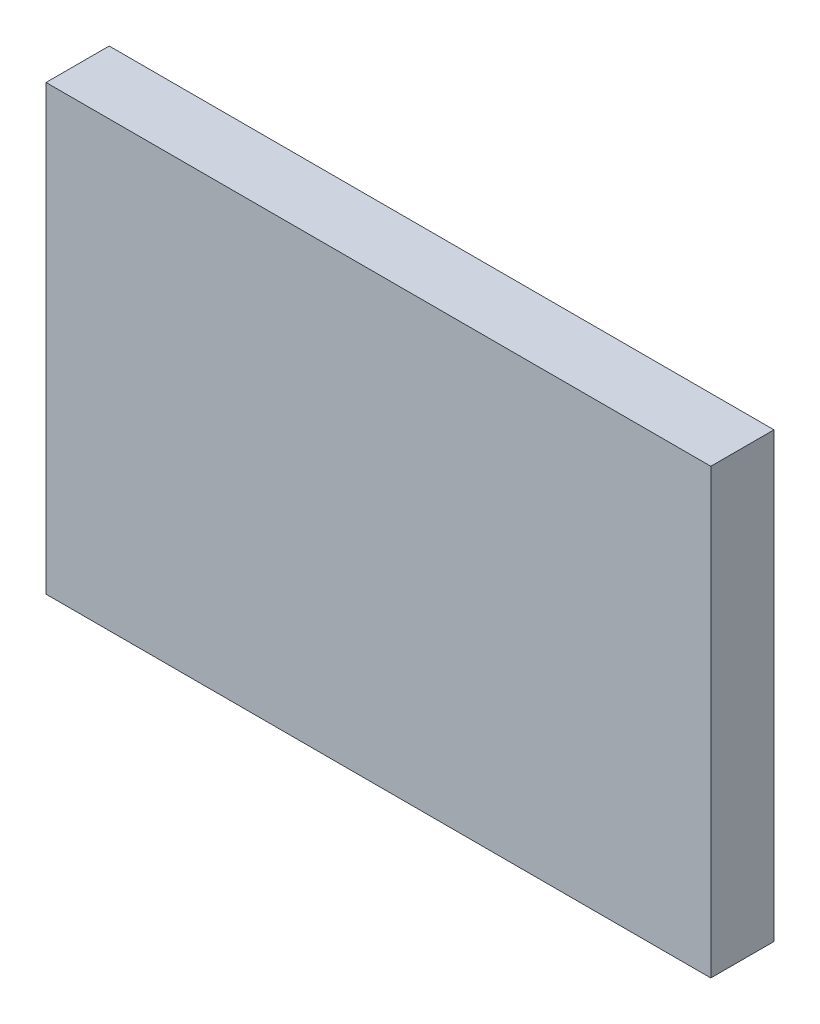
ISO-10303-21;
HEADER;
FILE_DESCRIPTION(('STEP AP214'),'2;1');
FILE_NAME('part.step','',(''),(''),'','','');
FILE_SCHEMA(('AUTOMOTIVE_DESIGN { 1 0 10303 214 1 1 1 1 }'));
ENDSEC;
DATA;
#1=APPLICATION_CONTEXT('core data for automotive mechanical design processes');
#2=APPLICATION_PROTOCOL_DEFINITION('international standard','automotive_design',2000,#1);
#3=PRODUCT_CONTEXT('',#1,'mechanical');
#4=PRODUCT('Part','Part','',(#3));
#5=PRODUCT_RELATED_PRODUCT_CATEGORY('part','',(#4));
#6=PRODUCT_DEFINITION_FORMATION('','',#4);
#7=PRODUCT_DEFINITION_CONTEXT('part definition',#1,'design');
#8=PRODUCT_DEFINITION('design','',#6,#7);
#9=PRODUCT_DEFINITION_SHAPE('','',#8);
#10=(LENGTH_UNIT() NAMED_UNIT(*) SI_UNIT(.MILLI.,.METRE.));
#11=(NAMED_UNIT(*) PLANE_ANGLE_UNIT() SI_UNIT($,.RADIAN.));
#12=(NAMED_UNIT(*) SI_UNIT($,.STERADIAN.) SOLID_ANGLE_UNIT());
#13=UNCERTAINTY_MEASURE_WITH_UNIT(LENGTH_MEASURE(1.E-05),#10,'distance_accuracy_value','');
#14=(GEOMETRIC_REPRESENTATION_CONTEXT(3) GLOBAL_UNCERTAINTY_ASSIGNED_CONTEXT((#13)) GLOBAL_UNIT_ASSIGNED_CONTEXT((#10,
#11,#12)) REPRESENTATION_CONTEXT('',''));
#15=CARTESIAN_POINT('',(0.,0.,0.));
#16=DIRECTION('',(0.,0.,1.));
#17=DIRECTION('',(1.,0.,0.));
#18=AXIS2_PLACEMENT_3D('',#15,#16,#17);
#19=CARTESIAN_POINT('',(21.6975142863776,12.7075775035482,5.7));
#20=DIRECTION('',(1.,0.,0.));
#21=DIRECTION('',(0.,1.,0.));
#22=AXIS2_PLACEMENT_3D('',#19,#20,#21);
#23=PLANE('',#22);
#24=DIRECTION('',(0.,-1.,0.));
#25=VECTOR('',#24,1.);
#26=CARTESIAN_POINT('',(21.6975142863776,12.7075775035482,0.));
#27=LINE('',#26,#25);
#28=CARTESIAN_POINT('',(21.6975142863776,12.7075775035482,0.));
#29=VERTEX_POINT('',#28);
#30=CARTESIAN_POINT('',(21.6975142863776,-27.2924224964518,0.));
#31=VERTEX_POINT('',#30);
#32=EDGE_CURVE('E95',#29,#31,#27,.T.);
#33=ORIENTED_EDGE('',*,*,#32,.T.);
#34=DIRECTION('',(0.,0.,-1.));
#35=VECTOR('',#34,1.);
#36=CARTESIAN_POINT('',(21.6975142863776,-27.2924224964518,5.7));
#37=LINE('',#36,#35);
#38=CARTESIAN_POINT('',(21.6975142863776,-27.2924224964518,5.7));
#39=VERTEX_POINT('',#38);
#40=EDGE_CURVE('E11',#39,#31,#37,.T.);
#41=ORIENTED_EDGE('',*,*,#40,.F.);
#42=DIRECTION('',(0.,-1.,0.));
#43=VECTOR('',#42,1.);
#44=CARTESIAN_POINT('',(21.6975142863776,12.7075775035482,5.7));
#45=LINE('',#44,#43);
#46=CARTESIAN_POINT('',(21.6975142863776,12.7075775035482,5.7));
#47=VERTEX_POINT('',#46);
#48=EDGE_CURVE('E83',#47,#39,#45,.T.);
#49=ORIENTED_EDGE('',*,*,#48,.F.);
#50=DIRECTION('',(0.,0.,-1.));
#51=VECTOR('',#50,1.);
#52=CARTESIAN_POINT('',(21.6975142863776,12.7075775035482,5.7));
#53=LINE('',#52,#51);
#54=EDGE_CURVE('E91',#47,#29,#53,.T.);
#55=ORIENTED_EDGE('',*,*,#54,.T.);
#56=EDGE_LOOP('',(#33,#41,#49,#55));
#57=FACE_BOUND('',#56,.T.);
#58=ADVANCED_FACE('F32',(#57),#23,.F.);
#59=CARTESIAN_POINT('',(21.6975142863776,-27.2924224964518,5.7));
#60=DIRECTION('',(0.,1.,0.));
#61=DIRECTION('',(0.,0.,1.));
#62=AXIS2_PLACEMENT_3D('',#59,#60,#61);
#63=PLANE('',#62);
#64=DIRECTION('',(1.,0.,0.));
#65=VECTOR('',#64,1.);
#66=CARTESIAN_POINT('',(21.6975142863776,-27.2924224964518,0.));
#67=LINE('',#66,#65);
#68=CARTESIAN_POINT('',(81.6975142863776,-27.2924224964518,0.));
#69=VERTEX_POINT('',#68);
#70=EDGE_CURVE('E87',#31,#69,#67,.T.);
#71=ORIENTED_EDGE('',*,*,#70,.T.);
#72=DIRECTION('',(0.,0.,-1.));
#73=VECTOR('',#72,1.);
#74=CARTESIAN_POINT('',(81.6975142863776,-27.2924224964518,5.7));
#75=LINE('',#74,#73);
#76=CARTESIAN_POINT('',(81.6975142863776,-27.2924224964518,5.7));
#77=VERTEX_POINT('',#76);
#78=EDGE_CURVE('E40',#77,#69,#75,.T.);
#79=ORIENTED_EDGE('',*,*,#78,.F.);
#80=DIRECTION('',(1.,0.,0.));
#81=VECTOR('',#80,1.);
#82=CARTESIAN_POINT('',(21.6975142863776,-27.2924224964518,5.7));
#83=LINE('',#82,#81);
#84=EDGE_CURVE('E78',#39,#77,#83,.T.);
#85=ORIENTED_EDGE('',*,*,#84,.F.);
#86=ORIENTED_EDGE('',*,*,#40,.T.);
#87=EDGE_LOOP('',(#71,#79,#85,#86));
#88=FACE_BOUND('',#87,.T.);
#89=ADVANCED_FACE('F86',(#88),#63,.F.);
#90=CARTESIAN_POINT('',(81.6975142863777,12.7075775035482,5.7));
#91=DIRECTION('',(-1.,0.,0.));
#92=DIRECTION('',(0.,-1.,0.));
#93=AXIS2_PLACEMENT_3D('',#90,#91,#92);
#94=PLANE('',#93);
#95=DIRECTION('',(0.,1.,0.));
#96=VECTOR('',#95,1.);
#97=CARTESIAN_POINT('',(81.6975142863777,12.7075775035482,0.));
#98=LINE('',#97,#96);
#99=CARTESIAN_POINT('',(81.6975142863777,12.7075775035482,0.));
#100=VERTEX_POINT('',#99);
#101=EDGE_CURVE('E65',#69,#100,#98,.T.);
#102=ORIENTED_EDGE('',*,*,#101,.T.);
#103=DIRECTION('',(0.,0.,-1.));
#104=VECTOR('',#103,1.);
#105=CARTESIAN_POINT('',(81.6975142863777,12.7075775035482,5.7));
#106=LINE('',#105,#104);
#107=CARTESIAN_POINT('',(81.6975142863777,12.7075775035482,5.7));
#108=VERTEX_POINT('',#107);
#109=EDGE_CURVE('E88',#108,#100,#106,.T.);
#110=ORIENTED_EDGE('',*,*,#109,.F.);
#111=DIRECTION('',(0.,1.,0.));
#112=VECTOR('',#111,1.);
#113=CARTESIAN_POINT('',(81.6975142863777,12.7075775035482,5.7));
#114=LINE('',#113,#112);
#115=EDGE_CURVE('E81',#77,#108,#114,.T.);
#116=ORIENTED_EDGE('',*,*,#115,.F.);
#117=ORIENTED_EDGE('',*,*,#78,.T.);
#118=EDGE_LOOP('',(#102,#110,#116,#117));
#119=FACE_BOUND('',#118,.T.);
#120=ADVANCED_FACE('F89',(#119),#94,.F.);
#121=CARTESIAN_POINT('',(21.6975142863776,12.7075775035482,5.7));
#122=DIRECTION('',(0.,-1.,0.));
#123=DIRECTION('',(0.,0.,-1.));
#124=AXIS2_PLACEMENT_3D('',#121,#122,#123);
#125=PLANE('',#124);
#126=DIRECTION('',(-1.,0.,0.));
#127=VECTOR('',#126,1.);
#128=CARTESIAN_POINT('',(21.6975142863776,12.7075775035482,0.));
#129=LINE('',#128,#127);
#130=EDGE_CURVE('E71',#100,#29,#129,.T.);
#131=ORIENTED_EDGE('',*,*,#130,.T.);
#132=ORIENTED_EDGE('',*,*,#54,.F.);
#133=DIRECTION('',(-1.,0.,0.));
#134=VECTOR('',#133,1.);
#135=CARTESIAN_POINT('',(21.6975142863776,12.7075775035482,5.7));
#136=LINE('',#135,#134);
#137=EDGE_CURVE('E48',#108,#47,#136,.T.);
#138=ORIENTED_EDGE('',*,*,#137,.F.);
#139=ORIENTED_EDGE('',*,*,#109,.T.);
#140=EDGE_LOOP('',(#131,#132,#138,#139));
#141=FACE_BOUND('',#140,.T.);
#142=ADVANCED_FACE('F102',(#141),#125,.F.);
#143=CARTESIAN_POINT('',(0.,0.,5.7));
#144=DIRECTION('',(0.,0.,1.));
#145=DIRECTION('',(1.,0.,0.));
#146=AXIS2_PLACEMENT_3D('',#143,#144,#145);
#147=PLANE('',#146);
#148=ORIENTED_EDGE('',*,*,#48,.T.);
#149=ORIENTED_EDGE('',*,*,#84,.T.);
#150=ORIENTED_EDGE('',*,*,#115,.T.);
#151=ORIENTED_EDGE('',*,*,#137,.T.);
#152=EDGE_LOOP('',(#148,#149,#150,#151));
#153=FACE_BOUND('',#152,.T.);
#154=ADVANCED_FACE('F79',(#153),#147,.T.);
#155=CARTESIAN_POINT('',(0.,0.,0.));
#156=DIRECTION('',(0.,0.,1.));
#157=DIRECTION('',(1.,0.,0.));
#158=AXIS2_PLACEMENT_3D('',#155,#156,#157);
#159=PLANE('',#158);
#160=ORIENTED_EDGE('',*,*,#32,.F.);
#161=ORIENTED_EDGE('',*,*,#130,.F.);
#162=ORIENTED_EDGE('',*,*,#101,.F.);
#163=ORIENTED_EDGE('',*,*,#70,.F.);
#164=EDGE_LOOP('',(#160,#161,#162,#163));
#165=FACE_BOUND('',#164,.T.);
#166=ADVANCED_FACE('F105',(#165),#159,.F.);
#167=CLOSED_SHELL('',(#58,#89,#120,#142,#154,#166));
#168=MANIFOLD_SOLID_BREP('B2',#167);
#169=ADVANCED_BREP_SHAPE_REPRESENTATION('',(#18,#168),#14);
#170=SHAPE_DEFINITION_REPRESENTATION(#9,#169);
ENDSEC;
END-ISO-10303-21;
